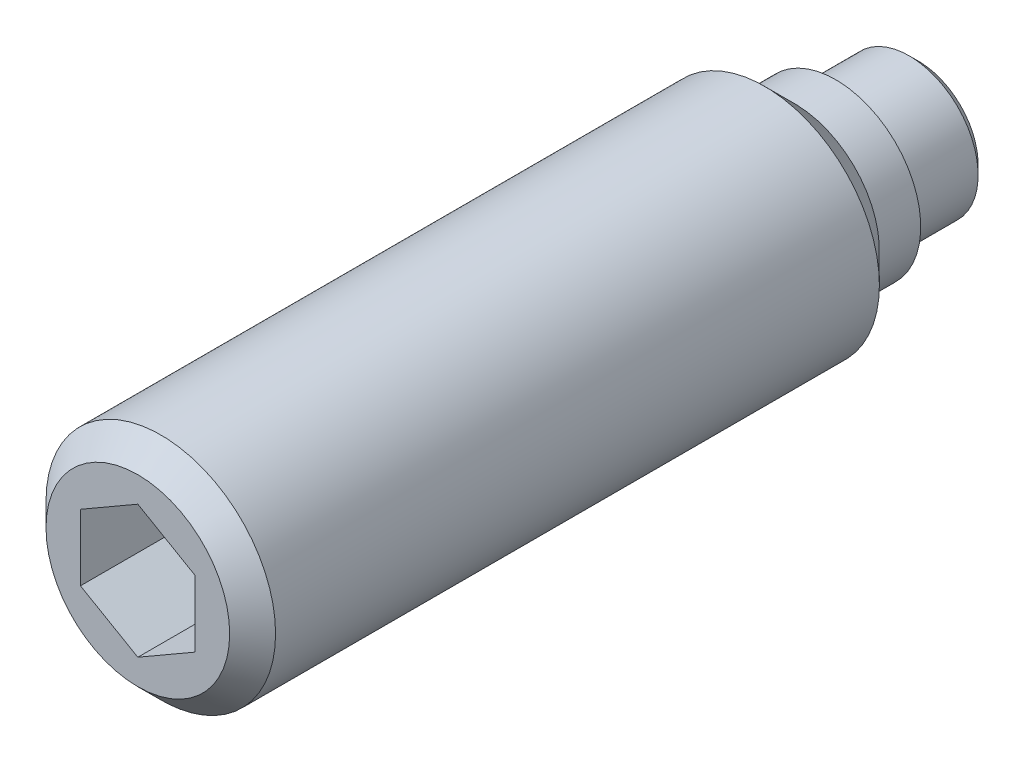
ISO-10303-21;
HEADER;
FILE_DESCRIPTION(('STEP AP214'),'2;1');
FILE_NAME('part.step','',(''),(''),'','','');
FILE_SCHEMA(('AUTOMOTIVE_DESIGN { 1 0 10303 214 1 1 1 1 }'));
ENDSEC;
DATA;
#1=APPLICATION_CONTEXT('core data for automotive mechanical design processes');
#2=APPLICATION_PROTOCOL_DEFINITION('international standard','automotive_design',2000,#1);
#3=PRODUCT_CONTEXT('',#1,'mechanical');
#4=PRODUCT('Part','Part','',(#3));
#5=PRODUCT_RELATED_PRODUCT_CATEGORY('part','',(#4));
#6=PRODUCT_DEFINITION_FORMATION('','',#4);
#7=PRODUCT_DEFINITION_CONTEXT('part definition',#1,'design');
#8=PRODUCT_DEFINITION('design','',#6,#7);
#9=PRODUCT_DEFINITION_SHAPE('','',#8);
#10=(LENGTH_UNIT() NAMED_UNIT(*) SI_UNIT(.MILLI.,.METRE.));
#11=(NAMED_UNIT(*) PLANE_ANGLE_UNIT() SI_UNIT($,.RADIAN.));
#12=(NAMED_UNIT(*) SI_UNIT($,.STERADIAN.) SOLID_ANGLE_UNIT());
#13=UNCERTAINTY_MEASURE_WITH_UNIT(LENGTH_MEASURE(1.E-05),#10,'distance_accuracy_value','');
#14=(GEOMETRIC_REPRESENTATION_CONTEXT(3) GLOBAL_UNCERTAINTY_ASSIGNED_CONTEXT((#13)) GLOBAL_UNIT_ASSIGNED_CONTEXT((#10,
#11,#12)) REPRESENTATION_CONTEXT('',''));
#15=CARTESIAN_POINT('',(0.,0.,0.));
#16=DIRECTION('',(0.,0.,1.));
#17=DIRECTION('',(1.,0.,0.));
#18=AXIS2_PLACEMENT_3D('',#15,#16,#17);
#19=CARTESIAN_POINT('',(0.,0.,1.8));
#20=DIRECTION('',(0.,0.,-1.));
#21=DIRECTION('',(-1.,0.,0.));
#22=AXIS2_PLACEMENT_3D('',#19,#20,#21);
#23=CYLINDRICAL_SURFACE('',#22,2.5);
#24=CARTESIAN_POINT('',(0.,0.,3.35));
#25=DIRECTION('',(0.,0.,-1.));
#26=DIRECTION('',(-1.,0.,0.));
#27=AXIS2_PLACEMENT_3D('',#24,#25,#26);
#28=CIRCLE('',#27,2.5);
#29=CARTESIAN_POINT('',(-2.5,0.,3.35));
#30=VERTEX_POINT('',#29);
#31=EDGE_CURVE('E9',#30,#30,#28,.T.);
#32=ORIENTED_EDGE('',*,*,#31,.F.);
#33=EDGE_LOOP('',(#32));
#34=FACE_BOUND('',#33,.T.);
#35=CARTESIAN_POINT('',(0.,0.,16.5));
#36=DIRECTION('',(0.,0.,1.));
#37=DIRECTION('',(1.,0.,0.));
#38=AXIS2_PLACEMENT_3D('',#35,#36,#37);
#39=CIRCLE('',#38,2.5);
#40=CARTESIAN_POINT('',(2.5,0.,16.5));
#41=VERTEX_POINT('',#40);
#42=EDGE_CURVE('E123',#41,#41,#39,.T.);
#43=ORIENTED_EDGE('',*,*,#42,.F.);
#44=EDGE_LOOP('',(#43));
#45=FACE_BOUND('',#44,.T.);
#46=ADVANCED_FACE('F14',(#34,#45),#23,.T.);
#47=CARTESIAN_POINT('',(0.,0.,3.35));
#48=DIRECTION('',(0.,0.,1.));
#49=DIRECTION('',(1.,0.,0.));
#50=AXIS2_PLACEMENT_3D('',#47,#48,#49);
#51=CONICAL_SURFACE('',#50,2.5,0.785398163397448);
#52=ORIENTED_EDGE('',*,*,#31,.T.);
#53=EDGE_LOOP('',(#52));
#54=FACE_BOUND('',#53,.T.);
#55=CARTESIAN_POINT('',(0.,0.,2.7));
#56=DIRECTION('',(0.,0.,-1.));
#57=DIRECTION('',(-1.,0.,0.));
#58=AXIS2_PLACEMENT_3D('',#55,#56,#57);
#59=CIRCLE('',#58,1.85);
#60=CARTESIAN_POINT('',(-1.85,0.,2.7));
#61=VERTEX_POINT('',#60);
#62=EDGE_CURVE('E21',#61,#61,#59,.T.);
#63=ORIENTED_EDGE('',*,*,#62,.F.);
#64=EDGE_LOOP('',(#63));
#65=FACE_BOUND('',#64,.T.);
#66=ADVANCED_FACE('F143',(#54,#65),#51,.T.);
#67=CARTESIAN_POINT('',(0.,0.,1.8));
#68=DIRECTION('',(0.,0.,-1.));
#69=DIRECTION('',(-1.,0.,0.));
#70=AXIS2_PLACEMENT_3D('',#67,#68,#69);
#71=CYLINDRICAL_SURFACE('',#70,1.85);
#72=ORIENTED_EDGE('',*,*,#62,.T.);
#73=EDGE_LOOP('',(#72));
#74=FACE_BOUND('',#73,.T.);
#75=CARTESIAN_POINT('',(0.,0.,1.8));
#76=DIRECTION('',(0.,0.,-1.));
#77=DIRECTION('',(-1.,0.,0.));
#78=AXIS2_PLACEMENT_3D('',#75,#76,#77);
#79=CIRCLE('',#78,1.85);
#80=CARTESIAN_POINT('',(-1.85,0.,1.8));
#81=VERTEX_POINT('',#80);
#82=EDGE_CURVE('E135',#81,#81,#79,.T.);
#83=ORIENTED_EDGE('',*,*,#82,.F.);
#84=EDGE_LOOP('',(#83));
#85=FACE_BOUND('',#84,.T.);
#86=ADVANCED_FACE('F140',(#74,#85),#71,.T.);
#87=CARTESIAN_POINT('',(0.,1.85,1.8));
#88=DIRECTION('',(0.,0.,1.));
#89=DIRECTION('',(1.,0.,0.));
#90=AXIS2_PLACEMENT_3D('',#87,#88,#89);
#91=PLANE('',#90);
#92=ORIENTED_EDGE('',*,*,#82,.T.);
#93=EDGE_LOOP('',(#92));
#94=FACE_BOUND('',#93,.T.);
#95=CARTESIAN_POINT('',(0.,0.,1.8));
#96=DIRECTION('',(0.,0.,-1.));
#97=DIRECTION('',(-1.,0.,0.));
#98=AXIS2_PLACEMENT_3D('',#95,#96,#97);
#99=CIRCLE('',#98,1.5);
#100=CARTESIAN_POINT('',(-1.5,0.,1.8));
#101=VERTEX_POINT('',#100);
#102=EDGE_CURVE('E132',#101,#101,#99,.T.);
#103=ORIENTED_EDGE('',*,*,#102,.F.);
#104=EDGE_LOOP('',(#103));
#105=FACE_BOUND('',#104,.T.);
#106=ADVANCED_FACE('F151',(#94,#105),#91,.F.);
#107=CARTESIAN_POINT('',(0.,0.,0.));
#108=DIRECTION('',(0.,0.,-1.));
#109=DIRECTION('',(-1.,0.,0.));
#110=AXIS2_PLACEMENT_3D('',#107,#108,#109);
#111=CYLINDRICAL_SURFACE('',#110,1.5);
#112=CARTESIAN_POINT('',(0.,0.,0.2));
#113=DIRECTION('',(0.,0.,-1.));
#114=DIRECTION('',(-1.,0.,0.));
#115=AXIS2_PLACEMENT_3D('',#112,#113,#114);
#116=CIRCLE('',#115,1.5);
#117=CARTESIAN_POINT('',(-1.5,0.,0.2));
#118=VERTEX_POINT('',#117);
#119=EDGE_CURVE('E129',#118,#118,#116,.T.);
#120=ORIENTED_EDGE('',*,*,#119,.F.);
#121=EDGE_LOOP('',(#120));
#122=FACE_BOUND('',#121,.T.);
#123=ORIENTED_EDGE('',*,*,#102,.T.);
#124=EDGE_LOOP('',(#123));
#125=FACE_BOUND('',#124,.T.);
#126=ADVANCED_FACE('F157',(#122,#125),#111,.T.);
#127=CARTESIAN_POINT('',(0.,0.,0.2));
#128=DIRECTION('',(0.,0.,1.));
#129=DIRECTION('',(1.,0.,0.));
#130=AXIS2_PLACEMENT_3D('',#127,#128,#129);
#131=CONICAL_SURFACE('',#130,1.5,0.785398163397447);
#132=CARTESIAN_POINT('',(0.,0.,0.));
#133=DIRECTION('',(0.,0.,-1.));
#134=DIRECTION('',(-1.,0.,0.));
#135=AXIS2_PLACEMENT_3D('',#132,#133,#134);
#136=CIRCLE('',#135,1.3);
#137=CARTESIAN_POINT('',(-1.3,0.,0.));
#138=VERTEX_POINT('',#137);
#139=EDGE_CURVE('E126',#138,#138,#136,.T.);
#140=ORIENTED_EDGE('',*,*,#139,.F.);
#141=EDGE_LOOP('',(#140));
#142=FACE_BOUND('',#141,.T.);
#143=ORIENTED_EDGE('',*,*,#119,.T.);
#144=EDGE_LOOP('',(#143));
#145=FACE_BOUND('',#144,.T.);
#146=ADVANCED_FACE('F161',(#142,#145),#131,.T.);
#147=CARTESIAN_POINT('',(0.,1.3,0.));
#148=DIRECTION('',(0.,0.,1.));
#149=DIRECTION('',(1.,0.,0.));
#150=AXIS2_PLACEMENT_3D('',#147,#148,#149);
#151=PLANE('',#150);
#152=ORIENTED_EDGE('',*,*,#139,.T.);
#153=EDGE_LOOP('',(#152));
#154=FACE_BOUND('',#153,.T.);
#155=ADVANCED_FACE('F165',(#154),#151,.F.);
#156=CARTESIAN_POINT('',(0.,0.,17.));
#157=DIRECTION('',(0.,0.,-1.));
#158=DIRECTION('',(-1.,0.,0.));
#159=AXIS2_PLACEMENT_3D('',#156,#157,#158);
#160=CONICAL_SURFACE('',#159,2.,0.785398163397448);
#161=ORIENTED_EDGE('',*,*,#42,.T.);
#162=EDGE_LOOP('',(#161));
#163=FACE_BOUND('',#162,.T.);
#164=CARTESIAN_POINT('',(0.,0.,17.));
#165=DIRECTION('',(0.,0.,1.));
#166=DIRECTION('',(1.,0.,0.));
#167=AXIS2_PLACEMENT_3D('',#164,#165,#166);
#168=CIRCLE('',#167,2.);
#169=CARTESIAN_POINT('',(2.,0.,17.));
#170=VERTEX_POINT('',#169);
#171=EDGE_CURVE('E115',#170,#170,#168,.T.);
#172=ORIENTED_EDGE('',*,*,#171,.F.);
#173=EDGE_LOOP('',(#172));
#174=FACE_BOUND('',#173,.T.);
#175=ADVANCED_FACE('F169',(#163,#174),#160,.T.);
#176=CARTESIAN_POINT('',(0.,-2.,17.));
#177=DIRECTION('',(0.,0.,1.));
#178=DIRECTION('',(1.,0.,0.));
#179=AXIS2_PLACEMENT_3D('',#176,#177,#178);
#180=PLANE('',#179);
#181=DIRECTION('',(0.866025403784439,-0.5,0.));
#182=VECTOR('',#181,1.);
#183=CARTESIAN_POINT('',(-1.25,-0.721687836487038,17.));
#184=LINE('',#183,#182);
#185=CARTESIAN_POINT('',(-1.25,-0.721687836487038,17.));
#186=VERTEX_POINT('',#185);
#187=CARTESIAN_POINT('',(0.,-1.44337567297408,17.));
#188=VERTEX_POINT('',#187);
#189=EDGE_CURVE('E28',#186,#188,#184,.T.);
#190=ORIENTED_EDGE('',*,*,#189,.F.);
#191=DIRECTION('',(0.,-1.,0.));
#192=VECTOR('',#191,1.);
#193=CARTESIAN_POINT('',(-1.25,0.721687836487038,17.));
#194=LINE('',#193,#192);
#195=CARTESIAN_POINT('',(-1.25,0.721687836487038,17.));
#196=VERTEX_POINT('',#195);
#197=EDGE_CURVE('E111',#196,#186,#194,.T.);
#198=ORIENTED_EDGE('',*,*,#197,.F.);
#199=DIRECTION('',(-0.866025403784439,-0.5,0.));
#200=VECTOR('',#199,1.);
#201=CARTESIAN_POINT('',(0.,1.44337567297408,17.));
#202=LINE('',#201,#200);
#203=CARTESIAN_POINT('',(0.,1.44337567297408,17.));
#204=VERTEX_POINT('',#203);
#205=EDGE_CURVE('E109',#204,#196,#202,.T.);
#206=ORIENTED_EDGE('',*,*,#205,.F.);
#207=DIRECTION('',(-0.866025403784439,0.5,0.));
#208=VECTOR('',#207,1.);
#209=CARTESIAN_POINT('',(1.25,0.721687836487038,17.));
#210=LINE('',#209,#208);
#211=CARTESIAN_POINT('',(1.25,0.721687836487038,17.));
#212=VERTEX_POINT('',#211);
#213=EDGE_CURVE('E76',#212,#204,#210,.T.);
#214=ORIENTED_EDGE('',*,*,#213,.F.);
#215=DIRECTION('',(0.,1.,0.));
#216=VECTOR('',#215,1.);
#217=CARTESIAN_POINT('',(1.25,-0.721687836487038,17.));
#218=LINE('',#217,#216);
#219=CARTESIAN_POINT('',(1.25,-0.721687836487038,17.));
#220=VERTEX_POINT('',#219);
#221=EDGE_CURVE('E105',#220,#212,#218,.T.);
#222=ORIENTED_EDGE('',*,*,#221,.F.);
#223=DIRECTION('',(0.866025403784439,0.5,0.));
#224=VECTOR('',#223,1.);
#225=CARTESIAN_POINT('',(0.,-1.44337567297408,17.));
#226=LINE('',#225,#224);
#227=EDGE_CURVE('E102',#188,#220,#226,.T.);
#228=ORIENTED_EDGE('',*,*,#227,.F.);
#229=EDGE_LOOP('',(#190,#198,#206,#214,#222,#228));
#230=FACE_BOUND('',#229,.T.);
#231=ORIENTED_EDGE('',*,*,#171,.T.);
#232=EDGE_LOOP('',(#231));
#233=FACE_BOUND('',#232,.T.);
#234=ADVANCED_FACE('F173',(#230,#233),#180,.T.);
#235=CARTESIAN_POINT('',(-1.25,-0.721687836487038,14.));
#236=DIRECTION('',(-0.5,-0.866025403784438,0.));
#237=DIRECTION('',(0.866025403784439,-0.5,0.));
#238=AXIS2_PLACEMENT_3D('',#235,#236,#237);
#239=PLANE('',#238);
#240=ORIENTED_EDGE('',*,*,#189,.T.);
#241=DIRECTION('',(0.,0.,1.));
#242=VECTOR('',#241,1.);
#243=CARTESIAN_POINT('',(0.,-1.44337567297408,14.));
#244=LINE('',#243,#242);
#245=CARTESIAN_POINT('',(0.,-1.44337567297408,14.));
#246=VERTEX_POINT('',#245);
#247=EDGE_CURVE('E58',#246,#188,#244,.T.);
#248=ORIENTED_EDGE('',*,*,#247,.F.);
#249=DIRECTION('',(0.866025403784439,-0.5,0.));
#250=VECTOR('',#249,1.);
#251=CARTESIAN_POINT('',(-1.25,-0.721687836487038,14.));
#252=LINE('',#251,#250);
#253=CARTESIAN_POINT('',(-1.25,-0.721687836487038,14.));
#254=VERTEX_POINT('',#253);
#255=EDGE_CURVE('E113',#254,#246,#252,.T.);
#256=ORIENTED_EDGE('',*,*,#255,.F.);
#257=DIRECTION('',(0.,0.,1.));
#258=VECTOR('',#257,1.);
#259=CARTESIAN_POINT('',(-1.25,-0.721687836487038,14.));
#260=LINE('',#259,#258);
#261=EDGE_CURVE('E36',#254,#186,#260,.T.);
#262=ORIENTED_EDGE('',*,*,#261,.T.);
#263=EDGE_LOOP('',(#240,#248,#256,#262));
#264=FACE_BOUND('',#263,.T.);
#265=ADVANCED_FACE('F177',(#264),#239,.F.);
#266=CARTESIAN_POINT('',(-1.25,0.721687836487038,14.));
#267=DIRECTION('',(-1.,0.,0.));
#268=DIRECTION('',(0.,0.,1.));
#269=AXIS2_PLACEMENT_3D('',#266,#267,#268);
#270=PLANE('',#269);
#271=ORIENTED_EDGE('',*,*,#197,.T.);
#272=ORIENTED_EDGE('',*,*,#261,.F.);
#273=DIRECTION('',(0.,-1.,0.));
#274=VECTOR('',#273,1.);
#275=CARTESIAN_POINT('',(-1.25,0.721687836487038,14.));
#276=LINE('',#275,#274);
#277=CARTESIAN_POINT('',(-1.25,0.721687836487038,14.));
#278=VERTEX_POINT('',#277);
#279=EDGE_CURVE('E88',#278,#254,#276,.T.);
#280=ORIENTED_EDGE('',*,*,#279,.F.);
#281=DIRECTION('',(0.,0.,1.));
#282=VECTOR('',#281,1.);
#283=CARTESIAN_POINT('',(-1.25,0.721687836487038,14.));
#284=LINE('',#283,#282);
#285=EDGE_CURVE('E80',#278,#196,#284,.T.);
#286=ORIENTED_EDGE('',*,*,#285,.T.);
#287=EDGE_LOOP('',(#271,#272,#280,#286));
#288=FACE_BOUND('',#287,.T.);
#289=ADVANCED_FACE('F181',(#288),#270,.F.);
#290=CARTESIAN_POINT('',(0.,1.44337567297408,14.));
#291=DIRECTION('',(-0.5,0.866025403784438,0.));
#292=DIRECTION('',(-0.866025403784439,-0.5,0.));
#293=AXIS2_PLACEMENT_3D('',#290,#291,#292);
#294=PLANE('',#293);
#295=ORIENTED_EDGE('',*,*,#205,.T.);
#296=ORIENTED_EDGE('',*,*,#285,.F.);
#297=DIRECTION('',(-0.866025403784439,-0.5,0.));
#298=VECTOR('',#297,1.);
#299=CARTESIAN_POINT('',(0.,1.44337567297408,14.));
#300=LINE('',#299,#298);
#301=CARTESIAN_POINT('',(0.,1.44337567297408,14.));
#302=VERTEX_POINT('',#301);
#303=EDGE_CURVE('E84',#302,#278,#300,.T.);
#304=ORIENTED_EDGE('',*,*,#303,.F.);
#305=DIRECTION('',(0.,0.,1.));
#306=VECTOR('',#305,1.);
#307=CARTESIAN_POINT('',(0.,1.44337567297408,14.));
#308=LINE('',#307,#306);
#309=EDGE_CURVE('E69',#302,#204,#308,.T.);
#310=ORIENTED_EDGE('',*,*,#309,.T.);
#311=EDGE_LOOP('',(#295,#296,#304,#310));
#312=FACE_BOUND('',#311,.T.);
#313=ADVANCED_FACE('F85',(#312),#294,.F.);
#314=CARTESIAN_POINT('',(1.25,0.721687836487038,14.));
#315=DIRECTION('',(0.5,0.866025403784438,0.));
#316=DIRECTION('',(-0.866025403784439,0.5,0.));
#317=AXIS2_PLACEMENT_3D('',#314,#315,#316);
#318=PLANE('',#317);
#319=ORIENTED_EDGE('',*,*,#213,.T.);
#320=ORIENTED_EDGE('',*,*,#309,.F.);
#321=DIRECTION('',(-0.866025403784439,0.5,0.));
#322=VECTOR('',#321,1.);
#323=CARTESIAN_POINT('',(1.25,0.721687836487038,14.));
#324=LINE('',#323,#322);
#325=CARTESIAN_POINT('',(1.25,0.721687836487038,14.));
#326=VERTEX_POINT('',#325);
#327=EDGE_CURVE('E73',#326,#302,#324,.T.);
#328=ORIENTED_EDGE('',*,*,#327,.F.);
#329=DIRECTION('',(0.,0.,1.));
#330=VECTOR('',#329,1.);
#331=CARTESIAN_POINT('',(1.25,0.721687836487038,14.));
#332=LINE('',#331,#330);
#333=EDGE_CURVE('E81',#326,#212,#332,.T.);
#334=ORIENTED_EDGE('',*,*,#333,.T.);
#335=EDGE_LOOP('',(#319,#320,#328,#334));
#336=FACE_BOUND('',#335,.T.);
#337=ADVANCED_FACE('F71',(#336),#318,.F.);
#338=CARTESIAN_POINT('',(1.25,-0.721687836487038,14.));
#339=DIRECTION('',(1.,0.,0.));
#340=DIRECTION('',(0.,0.,-1.));
#341=AXIS2_PLACEMENT_3D('',#338,#339,#340);
#342=PLANE('',#341);
#343=ORIENTED_EDGE('',*,*,#221,.T.);
#344=ORIENTED_EDGE('',*,*,#333,.F.);
#345=DIRECTION('',(0.,1.,0.));
#346=VECTOR('',#345,1.);
#347=CARTESIAN_POINT('',(1.25,-0.721687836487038,14.));
#348=LINE('',#347,#346);
#349=CARTESIAN_POINT('',(1.25,-0.721687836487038,14.));
#350=VERTEX_POINT('',#349);
#351=EDGE_CURVE('E94',#350,#326,#348,.T.);
#352=ORIENTED_EDGE('',*,*,#351,.F.);
#353=DIRECTION('',(0.,0.,1.));
#354=VECTOR('',#353,1.);
#355=CARTESIAN_POINT('',(1.25,-0.721687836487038,14.));
#356=LINE('',#355,#354);
#357=EDGE_CURVE('E118',#350,#220,#356,.T.);
#358=ORIENTED_EDGE('',*,*,#357,.T.);
#359=EDGE_LOOP('',(#343,#344,#352,#358));
#360=FACE_BOUND('',#359,.T.);
#361=ADVANCED_FACE('F185',(#360),#342,.F.);
#362=CARTESIAN_POINT('',(0.,-1.44337567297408,14.));
#363=DIRECTION('',(0.5,-0.866025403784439,0.));
#364=DIRECTION('',(0.866025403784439,0.5,0.));
#365=AXIS2_PLACEMENT_3D('',#362,#363,#364);
#366=PLANE('',#365);
#367=ORIENTED_EDGE('',*,*,#227,.T.);
#368=ORIENTED_EDGE('',*,*,#357,.F.);
#369=DIRECTION('',(0.866025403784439,0.5,0.));
#370=VECTOR('',#369,1.);
#371=CARTESIAN_POINT('',(0.,-1.44337567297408,14.));
#372=LINE('',#371,#370);
#373=EDGE_CURVE('E96',#246,#350,#372,.T.);
#374=ORIENTED_EDGE('',*,*,#373,.F.);
#375=ORIENTED_EDGE('',*,*,#247,.T.);
#376=EDGE_LOOP('',(#367,#368,#374,#375));
#377=FACE_BOUND('',#376,.T.);
#378=ADVANCED_FACE('F182',(#377),#366,.F.);
#379=CARTESIAN_POINT('',(0.,0.,14.));
#380=DIRECTION('',(0.,0.,1.));
#381=DIRECTION('',(1.,0.,0.));
#382=AXIS2_PLACEMENT_3D('',#379,#380,#381);
#383=PLANE('',#382);
#384=ORIENTED_EDGE('',*,*,#255,.T.);
#385=ORIENTED_EDGE('',*,*,#373,.T.);
#386=ORIENTED_EDGE('',*,*,#351,.T.);
#387=ORIENTED_EDGE('',*,*,#327,.T.);
#388=ORIENTED_EDGE('',*,*,#303,.T.);
#389=ORIENTED_EDGE('',*,*,#279,.T.);
#390=EDGE_LOOP('',(#384,#385,#386,#387,#388,#389));
#391=FACE_BOUND('',#390,.T.);
#392=ADVANCED_FACE('F91',(#391),#383,.T.);
#393=CLOSED_SHELL('',(#46,#66,#86,#106,#126,#146,#155,#175,#234,#265,#289,#313,#337,#361,#378,#392));
#394=MANIFOLD_SOLID_BREP('B1',#393);
#395=ADVANCED_BREP_SHAPE_REPRESENTATION('',(#18,#394),#14);
#396=SHAPE_DEFINITION_REPRESENTATION(#9,#395);
ENDSEC;
END-ISO-10303-21;
